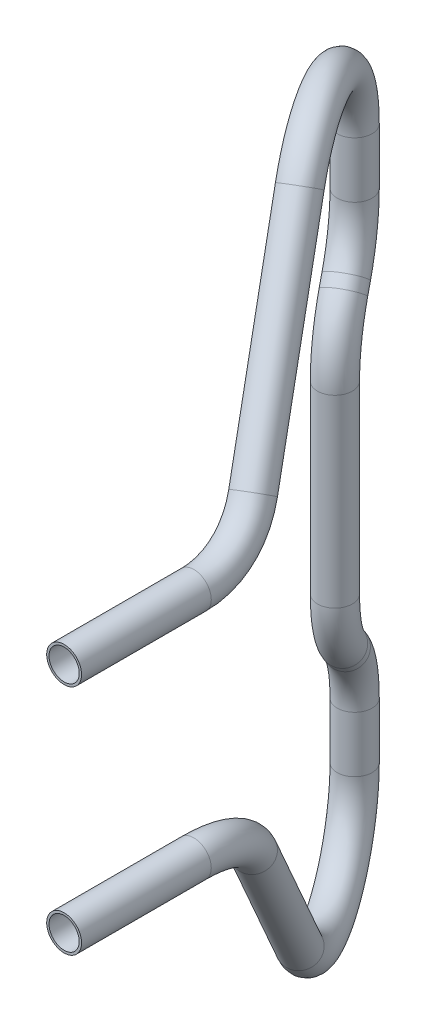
ISO-10303-21;
HEADER;
FILE_DESCRIPTION(('STEP AP214'),'2;1');
FILE_NAME('part.step','',(''),(''),'','','');
FILE_SCHEMA(('AUTOMOTIVE_DESIGN { 1 0 10303 214 1 1 1 1 }'));
ENDSEC;
DATA;
#1=APPLICATION_CONTEXT('core data for automotive mechanical design processes');
#2=APPLICATION_PROTOCOL_DEFINITION('international standard','automotive_design',2000,#1);
#3=PRODUCT_CONTEXT('',#1,'mechanical');
#4=PRODUCT('Part','Part','',(#3));
#5=PRODUCT_RELATED_PRODUCT_CATEGORY('part','',(#4));
#6=PRODUCT_DEFINITION_FORMATION('','',#4);
#7=PRODUCT_DEFINITION_CONTEXT('part definition',#1,'design');
#8=PRODUCT_DEFINITION('design','',#6,#7);
#9=PRODUCT_DEFINITION_SHAPE('','',#8);
#10=(LENGTH_UNIT() NAMED_UNIT(*) SI_UNIT(.MILLI.,.METRE.));
#11=(NAMED_UNIT(*) PLANE_ANGLE_UNIT() SI_UNIT($,.RADIAN.));
#12=(NAMED_UNIT(*) SI_UNIT($,.STERADIAN.) SOLID_ANGLE_UNIT());
#13=UNCERTAINTY_MEASURE_WITH_UNIT(LENGTH_MEASURE(1.E-05),#10,'distance_accuracy_value','');
#14=(GEOMETRIC_REPRESENTATION_CONTEXT(3) GLOBAL_UNCERTAINTY_ASSIGNED_CONTEXT((#13)) GLOBAL_UNIT_ASSIGNED_CONTEXT((#10,
#11,#12)) REPRESENTATION_CONTEXT('',''));
#15=CARTESIAN_POINT('',(0.,0.,0.));
#16=DIRECTION('',(0.,0.,1.));
#17=DIRECTION('',(1.,0.,0.));
#18=AXIS2_PLACEMENT_3D('',#15,#16,#17);
#19=CARTESIAN_POINT('',(-325.298110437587,-85.6754552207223,-340.422327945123));
#20=DIRECTION('',(0.,1.,0.));
#21=DIRECTION('',(0.,0.,1.));
#22=AXIS2_PLACEMENT_3D('',#19,#20,#21);
#23=CYLINDRICAL_SURFACE('',#22,15.);
#24=CARTESIAN_POINT('',(-325.298110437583,-85.6754552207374,-340.422327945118));
#25=DIRECTION('',(0.,1.,0.));
#26=DIRECTION('',(0.,0.,1.));
#27=AXIS2_PLACEMENT_3D('',#24,#25,#26);
#28=CIRCLE('',#27,15.);
#29=CARTESIAN_POINT('',(-317.652866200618,-85.6754552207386,-327.516893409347));
#30=VERTEX_POINT('',#29);
#31=EDGE_CURVE('E71',#30,#30,#28,.T.);
#32=ORIENTED_EDGE('',*,*,#31,.T.);
#33=EDGE_LOOP('',(#32));
#34=FACE_BOUND('',#33,.T.);
#35=CARTESIAN_POINT('',(-325.298110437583,72.9546758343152,-340.422327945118));
#36=DIRECTION('',(0.,1.,0.));
#37=DIRECTION('',(0.,0.,1.));
#38=AXIS2_PLACEMENT_3D('',#35,#36,#37);
#39=CIRCLE('',#38,15.);
#40=CARTESIAN_POINT('',(-317.652866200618,72.9546758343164,-327.516893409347));
#41=VERTEX_POINT('',#40);
#42=EDGE_CURVE('E88',#41,#41,#39,.T.);
#43=ORIENTED_EDGE('',*,*,#42,.F.);
#44=EDGE_LOOP('',(#43));
#45=FACE_BOUND('',#44,.T.);
#46=ADVANCED_FACE('F33',(#34,#45),#23,.T.);
#47=CARTESIAN_POINT('',(-349.928932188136,-244.423367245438,-382.));
#48=DIRECTION('',(0.,1.,0.));
#49=DIRECTION('',(-1.,0.,0.));
#50=AXIS2_PLACEMENT_3D('',#47,#48,#49);
#51=CYLINDRICAL_SURFACE('',#50,15.);
#52=CARTESIAN_POINT('',(-349.928932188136,-244.423367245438,-382.));
#53=DIRECTION('',(0.,1.,0.));
#54=DIRECTION('',(-0.693603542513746,0.,0.720356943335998));
#55=AXIS2_PLACEMENT_3D('',#52,#53,#54);
#56=CIRCLE('',#55,15.);
#57=CARTESIAN_POINT('',(-357.574176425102,-244.423367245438,-394.905434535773));
#58=VERTEX_POINT('',#57);
#59=EDGE_CURVE('E48',#58,#58,#56,.T.);
#60=ORIENTED_EDGE('',*,*,#59,.T.);
#61=EDGE_LOOP('',(#60));
#62=FACE_BOUND('',#61,.T.);
#63=CARTESIAN_POINT('',(-349.928932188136,-196.403248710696,-382.));
#64=DIRECTION('',(0.,1.,0.));
#65=DIRECTION('',(0.,0.,1.));
#66=AXIS2_PLACEMENT_3D('',#63,#64,#65);
#67=CIRCLE('',#66,15.);
#68=CARTESIAN_POINT('',(-357.574176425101,-196.403248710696,-394.905434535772));
#69=VERTEX_POINT('',#68);
#70=EDGE_CURVE('E80',#69,#69,#67,.T.);
#71=ORIENTED_EDGE('',*,*,#70,.F.);
#72=EDGE_LOOP('',(#71));
#73=FACE_BOUND('',#72,.T.);
#74=ADVANCED_FACE('F148',(#62,#73),#51,.T.);
#75=CARTESIAN_POINT('',(-349.928932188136,-244.423367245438,-382.));
#76=DIRECTION('',(0.,1.,0.));
#77=DIRECTION('',(-1.,0.,0.));
#78=AXIS2_PLACEMENT_3D('',#75,#76,#77);
#79=CYLINDRICAL_SURFACE('',#78,13.);
#80=CARTESIAN_POINT('',(-349.928932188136,-244.423367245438,-382.));
#81=DIRECTION('',(0.,1.,0.));
#82=DIRECTION('',(-0.693603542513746,0.,0.720356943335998));
#83=AXIS2_PLACEMENT_3D('',#80,#81,#82);
#84=CIRCLE('',#83,13.);
#85=CARTESIAN_POINT('',(-356.554810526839,-244.423367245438,-393.184709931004));
#86=VERTEX_POINT('',#85);
#87=EDGE_CURVE('E45',#86,#86,#84,.F.);
#88=ORIENTED_EDGE('',*,*,#87,.T.);
#89=EDGE_LOOP('',(#88));
#90=FACE_BOUND('',#89,.T.);
#91=CARTESIAN_POINT('',(-349.928932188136,-206.360389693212,-382.));
#92=DIRECTION('',(0.,1.,0.));
#93=DIRECTION('',(0.,0.,1.));
#94=AXIS2_PLACEMENT_3D('',#91,#92,#93);
#95=CIRCLE('',#94,13.);
#96=CARTESIAN_POINT('',(-349.928932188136,-206.360389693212,-369.));
#97=VERTEX_POINT('',#96);
#98=EDGE_CURVE('E37',#97,#97,#95,.T.);
#99=ORIENTED_EDGE('',*,*,#98,.T.);
#100=EDGE_LOOP('',(#99));
#101=FACE_BOUND('',#100,.T.);
#102=ADVANCED_FACE('F154',(#90,#101),#79,.F.);
#103=CARTESIAN_POINT('',(-209.928932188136,-106.360389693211,-91.9999999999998));
#104=DIRECTION('',(0.,0.,1.));
#105=DIRECTION('',(1.,0.,0.));
#106=AXIS2_PLACEMENT_3D('',#103,#104,#105);
#107=CYLINDRICAL_SURFACE('',#106,15.);
#108=CARTESIAN_POINT('',(-209.928932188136,-106.360389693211,8.00000000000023));
#109=DIRECTION('',(0.,0.,1.));
#110=DIRECTION('',(1.,0.,0.));
#111=AXIS2_PLACEMENT_3D('',#108,#109,#110);
#112=CIRCLE('',#111,15.);
#113=CARTESIAN_POINT('',(-194.928932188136,-106.360389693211,8.00000000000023));
#114=VERTEX_POINT('',#113);
#115=EDGE_CURVE('E11',#114,#114,#112,.T.);
#116=ORIENTED_EDGE('',*,*,#115,.F.);
#117=EDGE_LOOP('',(#116));
#118=FACE_BOUND('',#117,.T.);
#119=CARTESIAN_POINT('',(-209.928932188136,-106.360389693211,-103.638094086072));
#120=DIRECTION('',(0.,0.,-1.));
#121=DIRECTION('',(-1.,0.,0.));
#122=AXIS2_PLACEMENT_3D('',#119,#120,#121);
#123=CIRCLE('',#122,15.);
#124=CARTESIAN_POINT('',(-204.492238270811,-92.3803196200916,-103.638094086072));
#125=VERTEX_POINT('',#124);
#126=EDGE_CURVE('E58',#125,#125,#123,.T.);
#127=ORIENTED_EDGE('',*,*,#126,.F.);
#128=EDGE_LOOP('',(#127));
#129=FACE_BOUND('',#128,.T.);
#130=ADVANCED_FACE('F35',(#118,#129),#107,.T.);
#131=CARTESIAN_POINT('',(-209.928932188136,-106.360389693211,8.00000000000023));
#132=DIRECTION('',(0.,0.,1.));
#133=DIRECTION('',(1.,0.,0.));
#134=AXIS2_PLACEMENT_3D('',#131,#132,#133);
#135=PLANE('',#134);
#136=CARTESIAN_POINT('',(-209.928932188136,-106.360389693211,8.00000000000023));
#137=DIRECTION('',(0.,0.,1.));
#138=DIRECTION('',(1.,0.,0.));
#139=AXIS2_PLACEMENT_3D('',#136,#137,#138);
#140=CIRCLE('',#139,13.);
#141=CARTESIAN_POINT('',(-196.928932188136,-106.360389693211,8.00000000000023));
#142=VERTEX_POINT('',#141);
#143=EDGE_CURVE('E41',#142,#142,#140,.T.);
#144=ORIENTED_EDGE('',*,*,#143,.F.);
#145=EDGE_LOOP('',(#144));
#146=FACE_BOUND('',#145,.T.);
#147=ORIENTED_EDGE('',*,*,#115,.T.);
#148=EDGE_LOOP('',(#147));
#149=FACE_BOUND('',#148,.T.);
#150=ADVANCED_FACE('F196',(#146,#149),#135,.T.);
#151=CARTESIAN_POINT('',(-209.928932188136,-106.360389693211,-91.9999999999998));
#152=DIRECTION('',(0.,0.,1.));
#153=DIRECTION('',(1.,0.,0.));
#154=AXIS2_PLACEMENT_3D('',#151,#152,#153);
#155=CYLINDRICAL_SURFACE('',#154,13.);
#156=ORIENTED_EDGE('',*,*,#143,.T.);
#157=EDGE_LOOP('',(#156));
#158=FACE_BOUND('',#157,.T.);
#159=CARTESIAN_POINT('',(-209.928932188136,-106.360389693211,-103.638094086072));
#160=DIRECTION('',(0.,0.,-1.));
#161=DIRECTION('',(-1.,0.,0.));
#162=AXIS2_PLACEMENT_3D('',#159,#160,#161);
#163=CIRCLE('',#162,13.);
#164=CARTESIAN_POINT('',(-205.217130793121,-94.2443289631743,-103.638094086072));
#165=VERTEX_POINT('',#164);
#166=EDGE_CURVE('E51',#165,#165,#163,.F.);
#167=ORIENTED_EDGE('',*,*,#166,.F.);
#168=EDGE_LOOP('',(#167));
#169=FACE_BOUND('',#168,.T.);
#170=ADVANCED_FACE('F181',(#158,#169),#155,.F.);
#171=CARTESIAN_POINT('',(-237.112401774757,-176.260740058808,-103.638094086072));
#172=DIRECTION('',(-0.932004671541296,0.362446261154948,0.));
#173=DIRECTION('',(-0.362446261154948,-0.932004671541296,0.));
#174=AXIS2_PLACEMENT_3D('',#171,#172,#173);
#175=TOROIDAL_SURFACE('',#174,74.9999999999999,15.);
#176=CARTESIAN_POINT('',(-222.92558607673,-139.78035683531,-167.613995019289));
#177=DIRECTION('',(-0.309171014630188,-0.795011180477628,-0.52189127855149));
#178=DIRECTION('',(-0.937192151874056,0.161505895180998,0.309171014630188));
#179=AXIS2_PLACEMENT_3D('',#176,#177,#178);
#180=CIRCLE('',#179,15.);
#181=CARTESIAN_POINT('',(-220.088222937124,-132.48428019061,-180.409175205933));
#182=VERTEX_POINT('',#181);
#183=EDGE_CURVE('E55',#182,#182,#180,.T.);
#184=CARTESIAN_POINT('',(-237.112401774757,-176.260740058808,-103.638094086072));
#185=DIRECTION('',(-0.932004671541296,0.362446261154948,0.));
#186=DIRECTION('',(-0.362446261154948,-0.932004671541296,0.));
#187=AXIS2_PLACEMENT_3D('',#184,#185,#186);
#188=CIRCLE('',#187,90.);
#189=EDGE_CURVE('',#125,#182,#188,.T.);
#190=ORIENTED_EDGE('',*,*,#126,.T.);
#191=ORIENTED_EDGE('',*,*,#183,.F.);
#192=ORIENTED_EDGE('',*,*,#189,.T.);
#193=ORIENTED_EDGE('',*,*,#189,.F.);
#194=EDGE_LOOP('',(#190,#192,#191,#193));
#195=FACE_BOUND('',#194,.T.);
#196=ADVANCED_FACE('F168',(#195),#175,.T.);
#197=CARTESIAN_POINT('',(-222.92558607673,-139.78035683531,-167.613995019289));
#198=DIRECTION('',(-0.309171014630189,-0.795011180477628,-0.521891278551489));
#199=DIRECTION('',(0.,0.548777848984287,-0.835968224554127));
#200=AXIS2_PLACEMENT_3D('',#197,#198,#199);
#201=CYLINDRICAL_SURFACE('',#200,15.);
#202=CARTESIAN_POINT('',(-281.312437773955,-289.917975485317,-266.173003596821));
#203=DIRECTION('',(-0.309171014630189,-0.795011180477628,-0.521891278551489));
#204=DIRECTION('',(-0.937192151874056,0.161505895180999,0.309171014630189));
#205=AXIS2_PLACEMENT_3D('',#202,#203,#204);
#206=CIRCLE('',#205,15.);
#207=CARTESIAN_POINT('',(-275.234383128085,-299.016897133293,-255.913038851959));
#208=VERTEX_POINT('',#207);
#209=EDGE_CURVE('E52',#208,#208,#206,.T.);
#210=ORIENTED_EDGE('',*,*,#209,.F.);
#211=EDGE_LOOP('',(#210));
#212=FACE_BOUND('',#211,.T.);
#213=ORIENTED_EDGE('',*,*,#183,.T.);
#214=EDGE_LOOP('',(#213));
#215=FACE_BOUND('',#214,.T.);
#216=ADVANCED_FACE('F187',(#212,#215),#201,.T.);
#217=CARTESIAN_POINT('',(-311.702711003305,-244.423367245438,-317.472827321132));
#218=DIRECTION('',(0.860362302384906,0.,-0.509682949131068));
#219=DIRECTION('',(-0.509682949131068,0.,-0.860362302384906));
#220=AXIS2_PLACEMENT_3D('',#217,#218,#219);
#221=TOROIDAL_SURFACE('',#220,75.,15.);
#222=CARTESIAN_POINT('',(-311.702711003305,-244.423367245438,-317.472827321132));
#223=DIRECTION('',(0.860362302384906,0.,-0.509682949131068));
#224=DIRECTION('',(-0.509682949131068,0.,-0.860362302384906));
#225=AXIS2_PLACEMENT_3D('',#222,#223,#224);
#226=CIRCLE('',#225,90.);
#227=EDGE_CURVE('',#208,#58,#226,.T.);
#228=ORIENTED_EDGE('',*,*,#209,.T.);
#229=ORIENTED_EDGE('',*,*,#59,.F.);
#230=ORIENTED_EDGE('',*,*,#227,.T.);
#231=ORIENTED_EDGE('',*,*,#227,.F.);
#232=EDGE_LOOP('',(#228,#230,#229,#231));
#233=FACE_BOUND('',#232,.T.);
#234=ADVANCED_FACE('F173',(#233),#221,.T.);
#235=CARTESIAN_POINT('',(-237.112401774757,-176.260740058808,-103.638094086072));
#236=DIRECTION('',(-0.932004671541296,0.362446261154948,0.));
#237=DIRECTION('',(-0.362446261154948,-0.932004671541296,0.));
#238=AXIS2_PLACEMENT_3D('',#235,#236,#237);
#239=TOROIDAL_SURFACE('',#238,74.9999999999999,13.);
#240=CARTESIAN_POINT('',(-222.92558607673,-139.78035683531,-167.613995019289));
#241=DIRECTION('',(-0.309171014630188,-0.795011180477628,-0.52189127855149));
#242=DIRECTION('',(-0.937192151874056,0.161505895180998,0.309171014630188));
#243=AXIS2_PLACEMENT_3D('',#240,#241,#242);
#244=CIRCLE('',#243,13.);
#245=CARTESIAN_POINT('',(-220.466538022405,-133.457090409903,-178.703151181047));
#246=VERTEX_POINT('',#245);
#247=EDGE_CURVE('E66',#246,#246,#244,.F.);
#248=CARTESIAN_POINT('',(-237.112401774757,-176.260740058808,-103.638094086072));
#249=DIRECTION('',(-0.932004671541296,0.362446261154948,0.));
#250=DIRECTION('',(-0.362446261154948,-0.932004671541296,0.));
#251=AXIS2_PLACEMENT_3D('',#248,#249,#250);
#252=CIRCLE('',#251,87.9999999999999);
#253=EDGE_CURVE('',#165,#246,#252,.T.);
#254=ORIENTED_EDGE('',*,*,#166,.T.);
#255=ORIENTED_EDGE('',*,*,#247,.F.);
#256=ORIENTED_EDGE('',*,*,#253,.T.);
#257=ORIENTED_EDGE('',*,*,#253,.F.);
#258=EDGE_LOOP('',(#254,#256,#255,#257));
#259=FACE_BOUND('',#258,.T.);
#260=ADVANCED_FACE('F169',(#259),#239,.F.);
#261=CARTESIAN_POINT('',(-222.92558607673,-139.78035683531,-167.613995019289));
#262=DIRECTION('',(-0.309171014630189,-0.795011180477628,-0.521891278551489));
#263=DIRECTION('',(0.,0.548777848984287,-0.835968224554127));
#264=AXIS2_PLACEMENT_3D('',#261,#262,#263);
#265=CYLINDRICAL_SURFACE('',#264,13.);
#266=CARTESIAN_POINT('',(-281.312437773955,-289.917975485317,-266.173003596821));
#267=DIRECTION('',(-0.309171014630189,-0.795011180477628,-0.521891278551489));
#268=DIRECTION('',(-0.937192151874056,0.161505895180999,0.309171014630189));
#269=AXIS2_PLACEMENT_3D('',#266,#267,#268);
#270=CIRCLE('',#269,13.);
#271=CARTESIAN_POINT('',(-276.044790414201,-297.80370758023,-257.281034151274));
#272=VERTEX_POINT('',#271);
#273=EDGE_CURVE('E63',#272,#272,#270,.F.);
#274=ORIENTED_EDGE('',*,*,#273,.F.);
#275=EDGE_LOOP('',(#274));
#276=FACE_BOUND('',#275,.T.);
#277=ORIENTED_EDGE('',*,*,#247,.T.);
#278=EDGE_LOOP('',(#277));
#279=FACE_BOUND('',#278,.T.);
#280=ADVANCED_FACE('F172',(#276,#279),#265,.F.);
#281=CARTESIAN_POINT('',(-311.702711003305,-244.423367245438,-317.472827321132));
#282=DIRECTION('',(0.860362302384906,0.,-0.509682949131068));
#283=DIRECTION('',(-0.509682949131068,0.,-0.860362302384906));
#284=AXIS2_PLACEMENT_3D('',#281,#282,#283);
#285=TOROIDAL_SURFACE('',#284,75.,13.);
#286=CARTESIAN_POINT('',(-311.702711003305,-244.423367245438,-317.472827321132));
#287=DIRECTION('',(0.860362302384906,0.,-0.509682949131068));
#288=DIRECTION('',(-0.509682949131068,0.,-0.860362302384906));
#289=AXIS2_PLACEMENT_3D('',#286,#287,#288);
#290=CIRCLE('',#289,88.);
#291=EDGE_CURVE('',#272,#86,#290,.T.);
#292=ORIENTED_EDGE('',*,*,#273,.T.);
#293=ORIENTED_EDGE('',*,*,#87,.F.);
#294=ORIENTED_EDGE('',*,*,#291,.T.);
#295=ORIENTED_EDGE('',*,*,#291,.F.);
#296=EDGE_LOOP('',(#292,#294,#293,#295));
#297=FACE_BOUND('',#296,.T.);
#298=ADVANCED_FACE('F166',(#297),#285,.F.);
#299=CARTESIAN_POINT('',(-349.928932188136,-206.360389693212,-382.));
#300=DIRECTION('',(0.,1.,0.));
#301=DIRECTION('',(0.,0.,1.));
#302=AXIS2_PLACEMENT_3D('',#299,#300,#301);
#303=PLANE('',#302);
#304=ORIENTED_EDGE('',*,*,#98,.F.);
#305=EDGE_LOOP('',(#304));
#306=FACE_BOUND('',#305,.T.);
#307=ADVANCED_FACE('F162',(#306),#303,.F.);
#308=CARTESIAN_POINT('',(-311.702711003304,-196.403248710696,-317.472827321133));
#309=DIRECTION('',(0.860362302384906,0.,-0.509682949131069));
#310=DIRECTION('',(-0.509682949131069,0.,-0.860362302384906));
#311=AXIS2_PLACEMENT_3D('',#308,#309,#310);
#312=TOROIDAL_SURFACE('',#311,74.9999999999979,15.);
#313=CARTESIAN_POINT('',(-339.357784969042,-144.625636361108,-364.155540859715));
#314=DIRECTION('',(0.35186888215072,0.723458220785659,0.593966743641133));
#315=DIRECTION('',(-0.121266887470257,-0.593966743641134,0.795297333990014));
#316=AXIS2_PLACEMENT_3D('',#313,#314,#315);
#317=CIRCLE('',#316,15.);
#318=CARTESIAN_POINT('',(-344.888799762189,-134.270113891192,-373.49208356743));
#319=VERTEX_POINT('',#318);
#320=EDGE_CURVE('E77',#319,#319,#317,.T.);
#321=CARTESIAN_POINT('',(-311.702711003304,-196.403248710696,-317.472827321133));
#322=DIRECTION('',(0.860362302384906,0.,-0.509682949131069));
#323=DIRECTION('',(-0.509682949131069,0.,-0.860362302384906));
#324=AXIS2_PLACEMENT_3D('',#321,#322,#323);
#325=CIRCLE('',#324,89.9999999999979);
#326=EDGE_CURVE('',#69,#319,#325,.T.);
#327=ORIENTED_EDGE('',*,*,#70,.T.);
#328=ORIENTED_EDGE('',*,*,#320,.F.);
#329=ORIENTED_EDGE('',*,*,#326,.T.);
#330=ORIENTED_EDGE('',*,*,#326,.F.);
#331=EDGE_LOOP('',(#327,#329,#328,#330));
#332=FACE_BOUND('',#331,.T.);
#333=ADVANCED_FACE('F165',(#332),#312,.T.);
#334=CARTESIAN_POINT('',(-339.357784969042,-144.625636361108,-364.155540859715));
#335=DIRECTION('',(0.351868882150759,0.723458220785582,0.593966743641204));
#336=DIRECTION('',(0.,-0.63454643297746,0.772884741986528));
#337=AXIS2_PLACEMENT_3D('',#334,#335,#336);
#338=CYLINDRICAL_SURFACE('',#337,15.);
#339=CARTESIAN_POINT('',(-335.86925765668,-137.453067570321,-358.266787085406));
#340=DIRECTION('',(0.351868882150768,0.723458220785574,0.593966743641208));
#341=DIRECTION('',(-0.121266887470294,-0.593966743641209,0.795297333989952));
#342=AXIS2_PLACEMENT_3D('',#339,#340,#341);
#343=CIRCLE('',#342,15.);
#344=CARTESIAN_POINT('',(-330.338242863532,-147.808590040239,-348.930244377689));
#345=VERTEX_POINT('',#344);
#346=EDGE_CURVE('E74',#345,#345,#343,.T.);
#347=ORIENTED_EDGE('',*,*,#346,.F.);
#348=EDGE_LOOP('',(#347));
#349=FACE_BOUND('',#348,.T.);
#350=ORIENTED_EDGE('',*,*,#320,.T.);
#351=EDGE_LOOP('',(#350));
#352=FACE_BOUND('',#351,.T.);
#353=ADVANCED_FACE('F289',(#349,#352),#338,.T.);
#354=CARTESIAN_POINT('',(-363.524331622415,-85.6754552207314,-404.949500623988));
#355=DIRECTION('',(-0.860362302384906,0.,0.509682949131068));
#356=DIRECTION('',(0.509682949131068,0.,0.860362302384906));
#357=AXIS2_PLACEMENT_3D('',#354,#355,#356);
#358=TOROIDAL_SURFACE('',#357,75.,15.);
#359=CARTESIAN_POINT('',(-363.524331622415,-85.6754552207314,-404.949500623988));
#360=DIRECTION('',(-0.860362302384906,0.,0.509682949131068));
#361=DIRECTION('',(0.509682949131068,0.,0.860362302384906));
#362=AXIS2_PLACEMENT_3D('',#359,#360,#361);
#363=CIRCLE('',#362,90.0000000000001);
#364=EDGE_CURVE('',#345,#30,#363,.T.);
#365=ORIENTED_EDGE('',*,*,#346,.T.);
#366=ORIENTED_EDGE('',*,*,#31,.F.);
#367=ORIENTED_EDGE('',*,*,#364,.T.);
#368=ORIENTED_EDGE('',*,*,#364,.F.);
#369=EDGE_LOOP('',(#365,#367,#366,#368));
#370=FACE_BOUND('',#369,.T.);
#371=ADVANCED_FACE('F160',(#370),#358,.T.);
#372=CARTESIAN_POINT('',(-349.928932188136,231.702587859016,-382.));
#373=DIRECTION('',(0.,-1.,0.));
#374=DIRECTION('',(-1.,0.,0.));
#375=AXIS2_PLACEMENT_3D('',#372,#373,#374);
#376=CYLINDRICAL_SURFACE('',#375,15.);
#377=CARTESIAN_POINT('',(-349.928932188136,231.702587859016,-382.));
#378=DIRECTION('',(0.,1.,0.));
#379=DIRECTION('',(-0.693603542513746,0.,0.720356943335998));
#380=AXIS2_PLACEMENT_3D('',#377,#378,#379);
#381=CIRCLE('',#380,15.);
#382=CARTESIAN_POINT('',(-357.574176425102,231.702587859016,-394.905434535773));
#383=VERTEX_POINT('',#382);
#384=EDGE_CURVE('E95',#383,#383,#381,.T.);
#385=ORIENTED_EDGE('',*,*,#384,.F.);
#386=EDGE_LOOP('',(#385));
#387=FACE_BOUND('',#386,.T.);
#388=CARTESIAN_POINT('',(-349.928932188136,183.682469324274,-382.));
#389=DIRECTION('',(0.,1.,0.));
#390=DIRECTION('',(0.,0.,1.));
#391=AXIS2_PLACEMENT_3D('',#388,#389,#390);
#392=CIRCLE('',#391,15.);
#393=CARTESIAN_POINT('',(-357.574176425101,183.682469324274,-394.905434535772));
#394=VERTEX_POINT('',#393);
#395=EDGE_CURVE('E125',#394,#394,#392,.T.);
#396=ORIENTED_EDGE('',*,*,#395,.T.);
#397=EDGE_LOOP('',(#396));
#398=FACE_BOUND('',#397,.T.);
#399=ADVANCED_FACE('F129',(#387,#398),#376,.T.);
#400=CARTESIAN_POINT('',(-349.928932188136,231.702587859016,-382.));
#401=DIRECTION('',(0.,-1.,0.));
#402=DIRECTION('',(-1.,0.,0.));
#403=AXIS2_PLACEMENT_3D('',#400,#401,#402);
#404=CYLINDRICAL_SURFACE('',#403,13.);
#405=CARTESIAN_POINT('',(-349.928932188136,231.702587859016,-382.));
#406=DIRECTION('',(0.,1.,0.));
#407=DIRECTION('',(-0.693603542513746,0.,0.720356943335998));
#408=AXIS2_PLACEMENT_3D('',#405,#406,#407);
#409=CIRCLE('',#408,13.);
#410=CARTESIAN_POINT('',(-356.55481052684,231.702587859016,-393.184709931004));
#411=VERTEX_POINT('',#410);
#412=EDGE_CURVE('E94',#411,#411,#409,.F.);
#413=ORIENTED_EDGE('',*,*,#412,.F.);
#414=EDGE_LOOP('',(#413));
#415=FACE_BOUND('',#414,.T.);
#416=CARTESIAN_POINT('',(-349.928932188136,193.63961030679,-382.));
#417=DIRECTION('',(0.,1.,0.));
#418=DIRECTION('',(0.,0.,1.));
#419=AXIS2_PLACEMENT_3D('',#416,#417,#418);
#420=CIRCLE('',#419,13.);
#421=CARTESIAN_POINT('',(-349.928932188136,193.63961030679,-369.));
#422=VERTEX_POINT('',#421);
#423=EDGE_CURVE('E84',#422,#422,#420,.T.);
#424=ORIENTED_EDGE('',*,*,#423,.F.);
#425=EDGE_LOOP('',(#424));
#426=FACE_BOUND('',#425,.T.);
#427=ADVANCED_FACE('F318',(#415,#426),#404,.F.);
#428=CARTESIAN_POINT('',(-209.928932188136,93.639610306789,-91.9999999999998));
#429=DIRECTION('',(0.,0.,1.));
#430=DIRECTION('',(1.,0.,0.));
#431=AXIS2_PLACEMENT_3D('',#428,#429,#430);
#432=CYLINDRICAL_SURFACE('',#431,15.);
#433=CARTESIAN_POINT('',(-209.928932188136,93.639610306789,8.00000000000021));
#434=DIRECTION('',(0.,0.,-1.));
#435=DIRECTION('',(1.,0.,0.));
#436=AXIS2_PLACEMENT_3D('',#433,#434,#435);
#437=CIRCLE('',#436,15.);
#438=CARTESIAN_POINT('',(-194.928932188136,93.639610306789,8.00000000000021));
#439=VERTEX_POINT('',#438);
#440=EDGE_CURVE('E83',#439,#439,#437,.T.);
#441=ORIENTED_EDGE('',*,*,#440,.T.);
#442=EDGE_LOOP('',(#441));
#443=FACE_BOUND('',#442,.T.);
#444=CARTESIAN_POINT('',(-209.928932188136,93.639610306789,-103.638094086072));
#445=DIRECTION('',(0.,0.,1.));
#446=DIRECTION('',(-1.,0.,0.));
#447=AXIS2_PLACEMENT_3D('',#444,#445,#446);
#448=CIRCLE('',#447,15.);
#449=CARTESIAN_POINT('',(-204.492238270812,79.6595402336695,-103.638094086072));
#450=VERTEX_POINT('',#449);
#451=EDGE_CURVE('E87',#450,#450,#448,.T.);
#452=ORIENTED_EDGE('',*,*,#451,.T.);
#453=EDGE_LOOP('',(#452));
#454=FACE_BOUND('',#453,.T.);
#455=ADVANCED_FACE('F328',(#443,#454),#432,.T.);
#456=CARTESIAN_POINT('',(-209.928932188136,93.639610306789,8.00000000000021));
#457=DIRECTION('',(0.,0.,1.));
#458=DIRECTION('',(1.,0.,0.));
#459=AXIS2_PLACEMENT_3D('',#456,#457,#458);
#460=PLANE('',#459);
#461=CARTESIAN_POINT('',(-209.928932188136,93.639610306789,8.00000000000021));
#462=DIRECTION('',(0.,0.,-1.));
#463=DIRECTION('',(1.,0.,0.));
#464=AXIS2_PLACEMENT_3D('',#461,#462,#463);
#465=CIRCLE('',#464,13.);
#466=CARTESIAN_POINT('',(-196.928932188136,93.639610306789,8.00000000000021));
#467=VERTEX_POINT('',#466);
#468=EDGE_CURVE('E91',#467,#467,#465,.T.);
#469=ORIENTED_EDGE('',*,*,#468,.T.);
#470=EDGE_LOOP('',(#469));
#471=FACE_BOUND('',#470,.T.);
#472=ORIENTED_EDGE('',*,*,#440,.F.);
#473=EDGE_LOOP('',(#472));
#474=FACE_BOUND('',#473,.T.);
#475=ADVANCED_FACE('F339',(#471,#474),#460,.T.);
#476=CARTESIAN_POINT('',(-209.928932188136,93.639610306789,-91.9999999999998));
#477=DIRECTION('',(0.,0.,1.));
#478=DIRECTION('',(1.,0.,0.));
#479=AXIS2_PLACEMENT_3D('',#476,#477,#478);
#480=CYLINDRICAL_SURFACE('',#479,13.);
#481=ORIENTED_EDGE('',*,*,#468,.F.);
#482=EDGE_LOOP('',(#481));
#483=FACE_BOUND('',#482,.T.);
#484=CARTESIAN_POINT('',(-209.928932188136,93.639610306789,-103.638094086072));
#485=DIRECTION('',(0.,0.,1.));
#486=DIRECTION('',(-1.,0.,0.));
#487=AXIS2_PLACEMENT_3D('',#484,#485,#486);
#488=CIRCLE('',#487,13.);
#489=CARTESIAN_POINT('',(-205.217130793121,81.5235495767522,-103.638094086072));
#490=VERTEX_POINT('',#489);
#491=EDGE_CURVE('E98',#490,#490,#488,.F.);
#492=ORIENTED_EDGE('',*,*,#491,.T.);
#493=EDGE_LOOP('',(#492));
#494=FACE_BOUND('',#493,.T.);
#495=ADVANCED_FACE('F349',(#483,#494),#480,.F.);
#496=CARTESIAN_POINT('',(-237.112401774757,163.539960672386,-103.638094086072));
#497=DIRECTION('',(-0.932004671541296,-0.362446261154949,0.));
#498=DIRECTION('',(-0.362446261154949,0.932004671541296,0.));
#499=AXIS2_PLACEMENT_3D('',#496,#497,#498);
#500=TOROIDAL_SURFACE('',#499,74.9999999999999,15.);
#501=CARTESIAN_POINT('',(-222.92558607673,127.059577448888,-167.613995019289));
#502=DIRECTION('',(0.309171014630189,-0.795011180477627,0.52189127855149));
#503=DIRECTION('',(-0.937192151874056,-0.161505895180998,0.309171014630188));
#504=AXIS2_PLACEMENT_3D('',#501,#502,#503);
#505=CIRCLE('',#504,15.);
#506=CARTESIAN_POINT('',(-220.088222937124,119.763500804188,-180.409175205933));
#507=VERTEX_POINT('',#506);
#508=EDGE_CURVE('E102',#507,#507,#505,.T.);
#509=CARTESIAN_POINT('',(-237.112401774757,163.539960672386,-103.638094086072));
#510=DIRECTION('',(-0.932004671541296,-0.362446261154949,0.));
#511=DIRECTION('',(-0.362446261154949,0.932004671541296,0.));
#512=AXIS2_PLACEMENT_3D('',#509,#510,#511);
#513=CIRCLE('',#512,90.);
#514=EDGE_CURVE('',#507,#450,#513,.T.);
#515=ORIENTED_EDGE('',*,*,#508,.T.);
#516=ORIENTED_EDGE('',*,*,#451,.F.);
#517=ORIENTED_EDGE('',*,*,#514,.T.);
#518=ORIENTED_EDGE('',*,*,#514,.F.);
#519=EDGE_LOOP('',(#515,#517,#516,#518));
#520=FACE_BOUND('',#519,.T.);
#521=ADVANCED_FACE('F360',(#520),#500,.T.);
#522=CARTESIAN_POINT('',(-222.92558607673,127.059577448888,-167.613995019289));
#523=DIRECTION('',(-0.309171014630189,0.795011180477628,-0.521891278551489));
#524=DIRECTION('',(0.,-0.548777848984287,-0.835968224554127));
#525=AXIS2_PLACEMENT_3D('',#522,#523,#524);
#526=CYLINDRICAL_SURFACE('',#525,15.);
#527=CARTESIAN_POINT('',(-281.312437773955,277.197196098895,-266.173003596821));
#528=DIRECTION('',(0.309171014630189,-0.795011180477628,0.521891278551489));
#529=DIRECTION('',(-0.937192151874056,-0.161505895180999,0.309171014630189));
#530=AXIS2_PLACEMENT_3D('',#527,#528,#529);
#531=CIRCLE('',#530,15.);
#532=CARTESIAN_POINT('',(-275.234383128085,286.296117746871,-255.913038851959));
#533=VERTEX_POINT('',#532);
#534=EDGE_CURVE('E99',#533,#533,#531,.T.);
#535=ORIENTED_EDGE('',*,*,#534,.T.);
#536=EDGE_LOOP('',(#535));
#537=FACE_BOUND('',#536,.T.);
#538=ORIENTED_EDGE('',*,*,#508,.F.);
#539=EDGE_LOOP('',(#538));
#540=FACE_BOUND('',#539,.T.);
#541=ADVANCED_FACE('F370',(#537,#540),#526,.T.);
#542=CARTESIAN_POINT('',(-311.702711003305,231.702587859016,-317.472827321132));
#543=DIRECTION('',(0.860362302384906,0.,-0.509682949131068));
#544=DIRECTION('',(-0.509682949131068,0.,-0.860362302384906));
#545=AXIS2_PLACEMENT_3D('',#542,#543,#544);
#546=TOROIDAL_SURFACE('',#545,75.,15.);
#547=CARTESIAN_POINT('',(-311.702711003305,231.702587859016,-317.472827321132));
#548=DIRECTION('',(0.860362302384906,0.,-0.509682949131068));
#549=DIRECTION('',(-0.509682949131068,0.,-0.860362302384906));
#550=AXIS2_PLACEMENT_3D('',#547,#548,#549);
#551=CIRCLE('',#550,90.);
#552=EDGE_CURVE('',#383,#533,#551,.T.);
#553=ORIENTED_EDGE('',*,*,#384,.T.);
#554=ORIENTED_EDGE('',*,*,#534,.F.);
#555=ORIENTED_EDGE('',*,*,#552,.T.);
#556=ORIENTED_EDGE('',*,*,#552,.F.);
#557=EDGE_LOOP('',(#553,#555,#554,#556));
#558=FACE_BOUND('',#557,.T.);
#559=ADVANCED_FACE('F380',(#558),#546,.T.);
#560=CARTESIAN_POINT('',(-237.112401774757,163.539960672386,-103.638094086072));
#561=DIRECTION('',(-0.932004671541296,-0.362446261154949,0.));
#562=DIRECTION('',(-0.362446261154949,0.932004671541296,0.));
#563=AXIS2_PLACEMENT_3D('',#560,#561,#562);
#564=TOROIDAL_SURFACE('',#563,74.9999999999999,13.);
#565=CARTESIAN_POINT('',(-222.92558607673,127.059577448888,-167.613995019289));
#566=DIRECTION('',(0.309171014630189,-0.795011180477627,0.52189127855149));
#567=DIRECTION('',(-0.937192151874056,-0.161505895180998,0.309171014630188));
#568=AXIS2_PLACEMENT_3D('',#565,#566,#567);
#569=CIRCLE('',#568,13.);
#570=CARTESIAN_POINT('',(-220.466538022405,120.736311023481,-178.703151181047));
#571=VERTEX_POINT('',#570);
#572=EDGE_CURVE('E112',#571,#571,#569,.F.);
#573=CARTESIAN_POINT('',(-237.112401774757,163.539960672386,-103.638094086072));
#574=DIRECTION('',(-0.932004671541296,-0.362446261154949,0.));
#575=DIRECTION('',(-0.362446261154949,0.932004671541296,0.));
#576=AXIS2_PLACEMENT_3D('',#573,#574,#575);
#577=CIRCLE('',#576,87.9999999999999);
#578=EDGE_CURVE('',#571,#490,#577,.T.);
#579=ORIENTED_EDGE('',*,*,#572,.T.);
#580=ORIENTED_EDGE('',*,*,#491,.F.);
#581=ORIENTED_EDGE('',*,*,#578,.T.);
#582=ORIENTED_EDGE('',*,*,#578,.F.);
#583=EDGE_LOOP('',(#579,#581,#580,#582));
#584=FACE_BOUND('',#583,.T.);
#585=ADVANCED_FACE('F390',(#584),#564,.F.);
#586=CARTESIAN_POINT('',(-222.92558607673,127.059577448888,-167.613995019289));
#587=DIRECTION('',(-0.309171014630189,0.795011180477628,-0.521891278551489));
#588=DIRECTION('',(0.,-0.548777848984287,-0.835968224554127));
#589=AXIS2_PLACEMENT_3D('',#586,#587,#588);
#590=CYLINDRICAL_SURFACE('',#589,13.);
#591=CARTESIAN_POINT('',(-281.312437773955,277.197196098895,-266.173003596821));
#592=DIRECTION('',(0.309171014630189,-0.795011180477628,0.521891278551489));
#593=DIRECTION('',(-0.937192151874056,-0.161505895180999,0.309171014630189));
#594=AXIS2_PLACEMENT_3D('',#591,#592,#593);
#595=CIRCLE('',#594,13.);
#596=CARTESIAN_POINT('',(-276.044790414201,285.082928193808,-257.281034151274));
#597=VERTEX_POINT('',#596);
#598=EDGE_CURVE('E109',#597,#597,#595,.F.);
#599=ORIENTED_EDGE('',*,*,#598,.T.);
#600=EDGE_LOOP('',(#599));
#601=FACE_BOUND('',#600,.T.);
#602=ORIENTED_EDGE('',*,*,#572,.F.);
#603=EDGE_LOOP('',(#602));
#604=FACE_BOUND('',#603,.T.);
#605=ADVANCED_FACE('F400',(#601,#604),#590,.F.);
#606=CARTESIAN_POINT('',(-311.702711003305,231.702587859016,-317.472827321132));
#607=DIRECTION('',(0.860362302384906,0.,-0.509682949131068));
#608=DIRECTION('',(-0.509682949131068,0.,-0.860362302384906));
#609=AXIS2_PLACEMENT_3D('',#606,#607,#608);
#610=TOROIDAL_SURFACE('',#609,75.,13.);
#611=CARTESIAN_POINT('',(-311.702711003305,231.702587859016,-317.472827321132));
#612=DIRECTION('',(0.860362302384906,0.,-0.509682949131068));
#613=DIRECTION('',(-0.509682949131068,0.,-0.860362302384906));
#614=AXIS2_PLACEMENT_3D('',#611,#612,#613);
#615=CIRCLE('',#614,88.);
#616=EDGE_CURVE('',#411,#597,#615,.T.);
#617=ORIENTED_EDGE('',*,*,#412,.T.);
#618=ORIENTED_EDGE('',*,*,#598,.F.);
#619=ORIENTED_EDGE('',*,*,#616,.T.);
#620=ORIENTED_EDGE('',*,*,#616,.F.);
#621=EDGE_LOOP('',(#617,#619,#618,#620));
#622=FACE_BOUND('',#621,.T.);
#623=ADVANCED_FACE('F144',(#622),#610,.F.);
#624=CARTESIAN_POINT('',(-349.928932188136,193.63961030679,-382.));
#625=DIRECTION('',(0.,-1.,0.));
#626=DIRECTION('',(0.,0.,1.));
#627=AXIS2_PLACEMENT_3D('',#624,#625,#626);
#628=PLANE('',#627);
#629=ORIENTED_EDGE('',*,*,#423,.T.);
#630=EDGE_LOOP('',(#629));
#631=FACE_BOUND('',#630,.T.);
#632=ADVANCED_FACE('F134',(#631),#628,.F.);
#633=CARTESIAN_POINT('',(-311.702711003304,183.682469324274,-317.472827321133));
#634=DIRECTION('',(0.860362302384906,0.,-0.509682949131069));
#635=DIRECTION('',(-0.509682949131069,0.,-0.860362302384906));
#636=AXIS2_PLACEMENT_3D('',#633,#634,#635);
#637=TOROIDAL_SURFACE('',#636,74.9999999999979,15.);
#638=CARTESIAN_POINT('',(-339.357784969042,131.904856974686,-364.155540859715));
#639=DIRECTION('',(-0.35186888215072,0.723458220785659,-0.593966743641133));
#640=DIRECTION('',(-0.121266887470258,0.593966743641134,0.795297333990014));
#641=AXIS2_PLACEMENT_3D('',#638,#639,#640);
#642=CIRCLE('',#641,15.);
#643=CARTESIAN_POINT('',(-344.888799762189,121.54933450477,-373.492083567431));
#644=VERTEX_POINT('',#643);
#645=EDGE_CURVE('E122',#644,#644,#642,.T.);
#646=CARTESIAN_POINT('',(-311.702711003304,183.682469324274,-317.472827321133));
#647=DIRECTION('',(0.860362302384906,0.,-0.509682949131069));
#648=DIRECTION('',(-0.509682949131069,0.,-0.860362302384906));
#649=AXIS2_PLACEMENT_3D('',#646,#647,#648);
#650=CIRCLE('',#649,89.9999999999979);
#651=EDGE_CURVE('',#644,#394,#650,.T.);
#652=ORIENTED_EDGE('',*,*,#645,.T.);
#653=ORIENTED_EDGE('',*,*,#395,.F.);
#654=ORIENTED_EDGE('',*,*,#651,.T.);
#655=ORIENTED_EDGE('',*,*,#651,.F.);
#656=EDGE_LOOP('',(#652,#654,#653,#655));
#657=FACE_BOUND('',#656,.T.);
#658=ADVANCED_FACE('F131',(#657),#637,.T.);
#659=CARTESIAN_POINT('',(-339.357784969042,131.904856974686,-364.155540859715));
#660=DIRECTION('',(0.351868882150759,-0.723458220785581,0.593966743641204));
#661=DIRECTION('',(0.,0.63454643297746,0.772884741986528));
#662=AXIS2_PLACEMENT_3D('',#659,#660,#661);
#663=CYLINDRICAL_SURFACE('',#662,15.);
#664=CARTESIAN_POINT('',(-335.86925765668,124.732288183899,-358.266787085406));
#665=DIRECTION('',(-0.351868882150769,0.723458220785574,-0.593966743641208));
#666=DIRECTION('',(-0.121266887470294,0.593966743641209,0.795297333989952));
#667=AXIS2_PLACEMENT_3D('',#664,#665,#666);
#668=CIRCLE('',#667,15.);
#669=CARTESIAN_POINT('',(-330.338242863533,135.087810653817,-348.930244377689));
#670=VERTEX_POINT('',#669);
#671=EDGE_CURVE('E119',#670,#670,#668,.T.);
#672=ORIENTED_EDGE('',*,*,#671,.T.);
#673=EDGE_LOOP('',(#672));
#674=FACE_BOUND('',#673,.T.);
#675=ORIENTED_EDGE('',*,*,#645,.F.);
#676=EDGE_LOOP('',(#675));
#677=FACE_BOUND('',#676,.T.);
#678=ADVANCED_FACE('F133',(#674,#677),#663,.T.);
#679=CARTESIAN_POINT('',(-363.524331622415,72.9546758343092,-404.949500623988));
#680=DIRECTION('',(-0.860362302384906,0.,0.509682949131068));
#681=DIRECTION('',(0.509682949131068,0.,0.860362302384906));
#682=AXIS2_PLACEMENT_3D('',#679,#680,#681);
#683=TOROIDAL_SURFACE('',#682,75.,15.);
#684=CARTESIAN_POINT('',(-363.524331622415,72.9546758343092,-404.949500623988));
#685=DIRECTION('',(-0.860362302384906,0.,0.509682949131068));
#686=DIRECTION('',(0.509682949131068,0.,0.860362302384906));
#687=AXIS2_PLACEMENT_3D('',#684,#685,#686);
#688=CIRCLE('',#687,90.0000000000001);
#689=EDGE_CURVE('',#41,#670,#688,.T.);
#690=ORIENTED_EDGE('',*,*,#42,.T.);
#691=ORIENTED_EDGE('',*,*,#671,.F.);
#692=ORIENTED_EDGE('',*,*,#689,.T.);
#693=ORIENTED_EDGE('',*,*,#689,.F.);
#694=EDGE_LOOP('',(#690,#692,#691,#693));
#695=FACE_BOUND('',#694,.T.);
#696=ADVANCED_FACE('F141',(#695),#683,.T.);
#697=CLOSED_SHELL('',(#46,#74,#102,#130,#150,#170,#196,#216,#234,#260,#280,#298,#307,#333,#353,
#371,#399,#427,#455,#475,#495,#521,#541,#559,#585,#605,#623,#632,#658,#678,#696));
#698=MANIFOLD_SOLID_BREP('B2',#697);
#699=ADVANCED_BREP_SHAPE_REPRESENTATION('',(#18,#698),#14);
#700=SHAPE_DEFINITION_REPRESENTATION(#9,#699);
ENDSEC;
END-ISO-10303-21;
